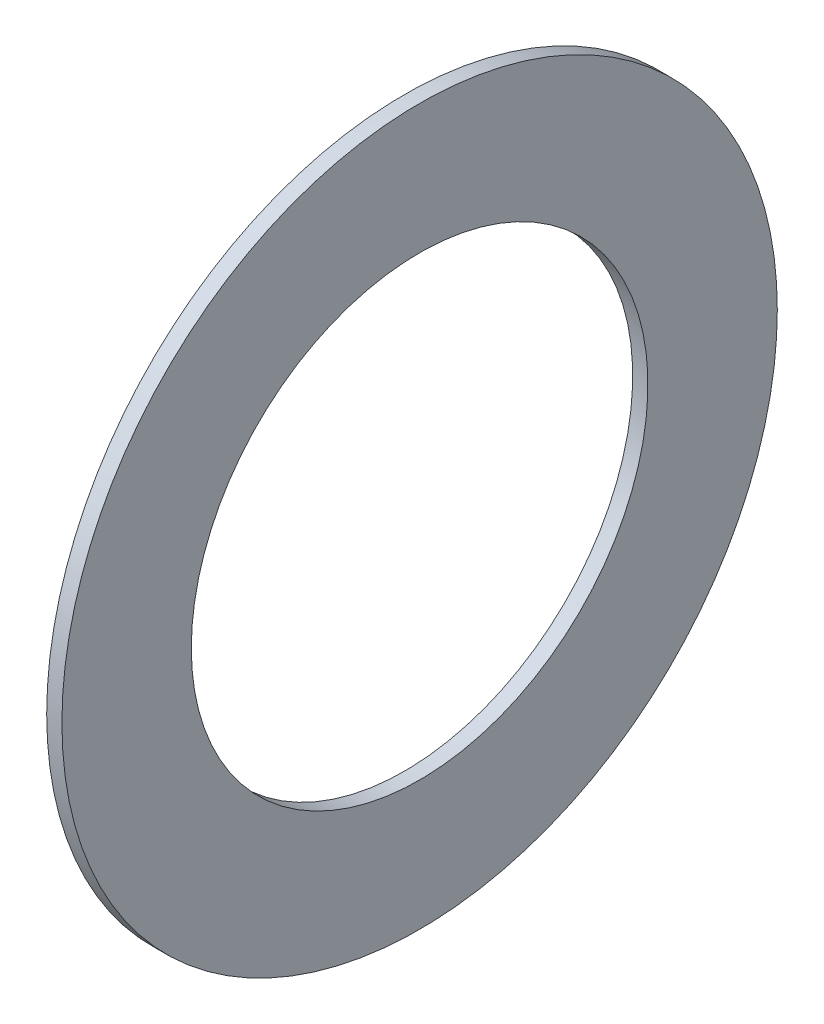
ISO-10303-21;
HEADER;
FILE_DESCRIPTION(('STEP AP214'),'2;1');
FILE_NAME('part.step','',(''),(''),'','','');
FILE_SCHEMA(('AUTOMOTIVE_DESIGN { 1 0 10303 214 1 1 1 1 }'));
ENDSEC;
DATA;
#1=APPLICATION_CONTEXT('core data for automotive mechanical design processes');
#2=APPLICATION_PROTOCOL_DEFINITION('international standard','automotive_design',2000,#1);
#3=PRODUCT_CONTEXT('',#1,'mechanical');
#4=PRODUCT('Part','Part','',(#3));
#5=PRODUCT_RELATED_PRODUCT_CATEGORY('part','',(#4));
#6=PRODUCT_DEFINITION_FORMATION('','',#4);
#7=PRODUCT_DEFINITION_CONTEXT('part definition',#1,'design');
#8=PRODUCT_DEFINITION('design','',#6,#7);
#9=PRODUCT_DEFINITION_SHAPE('','',#8);
#10=(LENGTH_UNIT() NAMED_UNIT(*) SI_UNIT(.MILLI.,.METRE.));
#11=(NAMED_UNIT(*) PLANE_ANGLE_UNIT() SI_UNIT($,.RADIAN.));
#12=(NAMED_UNIT(*) SI_UNIT($,.STERADIAN.) SOLID_ANGLE_UNIT());
#13=UNCERTAINTY_MEASURE_WITH_UNIT(LENGTH_MEASURE(1.E-05),#10,'distance_accuracy_value','');
#14=(GEOMETRIC_REPRESENTATION_CONTEXT(3) GLOBAL_UNCERTAINTY_ASSIGNED_CONTEXT((#13)) GLOBAL_UNIT_ASSIGNED_CONTEXT((#10,
#11,#12)) REPRESENTATION_CONTEXT('',''));
#15=CARTESIAN_POINT('',(0.,0.,0.));
#16=DIRECTION('',(0.,0.,1.));
#17=DIRECTION('',(1.,0.,0.));
#18=AXIS2_PLACEMENT_3D('',#15,#16,#17);
#19=CARTESIAN_POINT('',(1.,15.,0.));
#20=DIRECTION('',(-1.,0.,0.));
#21=DIRECTION('',(0.,0.,1.));
#22=AXIS2_PLACEMENT_3D('',#19,#20,#21);
#23=PLANE('',#22);
#24=CARTESIAN_POINT('',(1.,0.,0.));
#25=DIRECTION('',(-1.,0.,0.));
#26=DIRECTION('',(0.,0.,1.));
#27=AXIS2_PLACEMENT_3D('',#24,#25,#26);
#28=CIRCLE('',#27,23.5);
#29=CARTESIAN_POINT('',(1.,0.,23.5));
#30=VERTEX_POINT('',#29);
#31=EDGE_CURVE('E360',#30,#30,#28,.T.);
#32=ORIENTED_EDGE('',*,*,#31,.F.);
#33=EDGE_LOOP('',(#32));
#34=FACE_BOUND('',#33,.T.);
#35=CARTESIAN_POINT('',(1.,0.,0.));
#36=DIRECTION('',(-1.,0.,0.));
#37=DIRECTION('',(0.,0.,1.));
#38=AXIS2_PLACEMENT_3D('',#35,#36,#37);
#39=CIRCLE('',#38,15.);
#40=CARTESIAN_POINT('',(1.,0.,15.));
#41=VERTEX_POINT('',#40);
#42=EDGE_CURVE('E10',#41,#41,#39,.T.);
#43=ORIENTED_EDGE('',*,*,#42,.T.);
#44=EDGE_LOOP('',(#43));
#45=FACE_BOUND('',#44,.T.);
#46=ADVANCED_FACE('F346',(#34,#45),#23,.F.);
#47=CARTESIAN_POINT('',(-2.00655414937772,0.,0.));
#48=DIRECTION('',(-1.,0.,0.));
#49=DIRECTION('',(0.,0.,1.));
#50=AXIS2_PLACEMENT_3D('',#47,#48,#49);
#51=CYLINDRICAL_SURFACE('',#50,15.);
#52=ORIENTED_EDGE('',*,*,#42,.F.);
#53=EDGE_LOOP('',(#52));
#54=FACE_BOUND('',#53,.T.);
#55=CARTESIAN_POINT('',(0.,0.,0.));
#56=DIRECTION('',(-1.,0.,0.));
#57=DIRECTION('',(0.,0.,1.));
#58=AXIS2_PLACEMENT_3D('',#55,#56,#57);
#59=CIRCLE('',#58,15.);
#60=CARTESIAN_POINT('',(0.,0.,15.));
#61=VERTEX_POINT('',#60);
#62=EDGE_CURVE('E352',#61,#61,#59,.T.);
#63=ORIENTED_EDGE('',*,*,#62,.T.);
#64=EDGE_LOOP('',(#63));
#65=FACE_BOUND('',#64,.T.);
#66=ADVANCED_FACE('F369',(#54,#65),#51,.F.);
#67=CARTESIAN_POINT('',(0.,15.,0.));
#68=DIRECTION('',(1.,0.,0.));
#69=DIRECTION('',(0.,0.,-1.));
#70=AXIS2_PLACEMENT_3D('',#67,#68,#69);
#71=PLANE('',#70);
#72=ORIENTED_EDGE('',*,*,#62,.F.);
#73=EDGE_LOOP('',(#72));
#74=FACE_BOUND('',#73,.T.);
#75=CARTESIAN_POINT('',(0.,0.,0.));
#76=DIRECTION('',(-1.,0.,0.));
#77=DIRECTION('',(0.,0.,1.));
#78=AXIS2_PLACEMENT_3D('',#75,#76,#77);
#79=CIRCLE('',#78,23.5);
#80=CARTESIAN_POINT('',(0.,0.,23.5));
#81=VERTEX_POINT('',#80);
#82=EDGE_CURVE('E356',#81,#81,#79,.T.);
#83=ORIENTED_EDGE('',*,*,#82,.T.);
#84=EDGE_LOOP('',(#83));
#85=FACE_BOUND('',#84,.T.);
#86=ADVANCED_FACE('F373',(#74,#85),#71,.F.);
#87=CARTESIAN_POINT('',(-2.00655414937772,0.,0.));
#88=DIRECTION('',(-1.,0.,0.));
#89=DIRECTION('',(0.,0.,1.));
#90=AXIS2_PLACEMENT_3D('',#87,#88,#89);
#91=CYLINDRICAL_SURFACE('',#90,23.5);
#92=ORIENTED_EDGE('',*,*,#82,.F.);
#93=EDGE_LOOP('',(#92));
#94=FACE_BOUND('',#93,.T.);
#95=ORIENTED_EDGE('',*,*,#31,.T.);
#96=EDGE_LOOP('',(#95));
#97=FACE_BOUND('',#96,.T.);
#98=ADVANCED_FACE('F366',(#94,#97),#91,.T.);
#99=CLOSED_SHELL('',(#46,#66,#86,#98));
#100=MANIFOLD_SOLID_BREP('B2',#99);
#101=ADVANCED_BREP_SHAPE_REPRESENTATION('',(#18,#100),#14);
#102=SHAPE_DEFINITION_REPRESENTATION(#9,#101);
ENDSEC;
END-ISO-10303-21;
